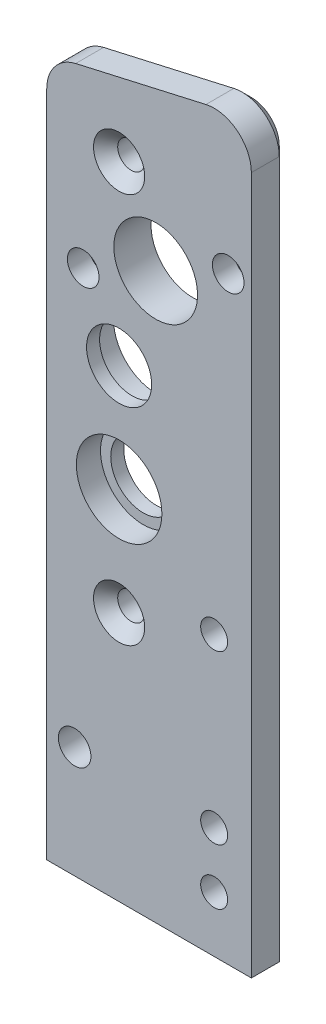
from build123d import *

# Parameters (mm, degrees)
RESSALTO_EXTRUS_O1_DEPTH                             = 4
FILETE1_R                                            = 4
CHANFRO1_SIZE                                        = 1
FURO_DE_DI_METRO_7_0_7_1_D                           = 7
ESCAREADO_PARA_PARAFUSO_COM_CABE_A_ESCAR_D           = 2.9
ESCAREADO_PARA_PARAFUSO_COM_CABE_A_ESCAR_CSINK_D     = 5.5
ESCAREADO_PARA_PARAFUSO_COM_CABE_A_ESCAR_CSINK_ANGLE = 90
BROCA_DE_ROSQUEAR_PARA_TARRAXA_DE_M21_D              = 1.6
BROCA_DE_ROSQUEAR_PARA_TARRAXA_DE_M21_DEPTH          = 8
BROCA_DE_ROSQUEAR_PARA_TARRAXA_DE_M21_TIP            = 0.480688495
FURO_DE_DI_METRO_9_0_9_3_D                           = 9
ESCAREADO_PARA_PARAFUSO_ALLEN_SEXTAVADO_D            = 3.4
ESCAREADO_PARA_PARAFUSO_ALLEN_SEXTAVADO_CSINK_D      = 6.72
ESCAREADO_PARA_PARAFUSO_ALLEN_SEXTAVADO_CSINK_ANGLE  = 90
ESCAREADO_PARA_PARAFUSO_COM_CABE_A_E_2_D             = 2.9
ESCAREADO_PARA_PARAFUSO_COM_CABE_A_E_2_DEPTH         = 4
ESCAREADO_PARA_PARAFUSO_COM_CABE_A_E_2_CSINK_D       = 5.5
ESCAREADO_PARA_PARAFUSO_COM_CABE_A_E_2_CSINK_ANGLE   = 90
ESCAREADO_PARA_PARAFUSO_COM_CABE_A_E_2_TIP           = 0.871247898
ESBO_O12_R                                           = 4.6
CORTE_EXTRUS_O1_DEPTH                                = 2.6
ESBO_O15_R                                           = 4.6
CORTE_EXTRUS_O2_DEPTH                                = 2.6
ESCAREADO_PARA_PARAFUSO_COM_CABE_A_E_3_D             = 2.9
ESCAREADO_PARA_PARAFUSO_COM_CABE_A_E_3_CSINK_D       = 5.5
ESCAREADO_PARA_PARAFUSO_COM_CABE_A_E_3_CSINK_ANGLE   = 90
FURO_DE_DI_METRO_7_0_7_2_D                           = 7
FURO_DE_DI_METRO_3_5_3_5_1_D                         = 3.5


with BuildPart() as part:
    # Esbo_o1 → Ressalto-extrus_o1 (new body)
    with BuildSketch(Plane.XY):
        Polygon((0, 0), (22, 0), (22, 80), (0, 75), align=None)
    extrude(amount=RESSALTO_EXTRUS_O1_DEPTH)

    # Filete1
    filete1_edges = [part.edges().sort_by_distance(p)[0] for p in [
        (0, 75, 2),
        (22, 80, 2),
    ]]
    fillet(filete1_edges, radius=FILETE1_R)

    # Chanfro1
    chanfro1_edges = [part.edges().sort_by_distance(p)[0] for p in [
        (10.113515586, 77.298526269, 0),
        (0, 35.903542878, 0),
        (0.873825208, 74.302487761, 0),
        (20.495402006, 78.115078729, 0),
        (22, 37.494451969, 0),
    ]]
    chamfer(chanfro1_edges, length=CHANFRO1_SIZE)

    # Furo de di_metro _7.0 _7_1 (through all)
    with Locations(Plane(origin=(7.780869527, 38.393713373, 0), x_dir=(-1, 0, 0), z_dir=(0, 0, -1))):
        with Locations((0, 0)):
            Hole(FURO_DE_DI_METRO_7_0_7_1_D / 2)

    # Escareado para parafuso com cabe_a escar (through all)
    with Locations(Plane(origin=(18, 6, 0), x_dir=(-1, 0, 0), z_dir=(0, 0, -1))):
        with Locations((0, 0), (0, 6)):
            CounterSinkHole(ESCAREADO_PARA_PARAFUSO_COM_CABE_A_ESCAR_D / 2, ESCAREADO_PARA_PARAFUSO_COM_CABE_A_ESCAR_CSINK_D / 2, counter_sink_angle=ESCAREADO_PARA_PARAFUSO_COM_CABE_A_ESCAR_CSINK_ANGLE)

    # Broca de rosquear para tarraxa de M21
    with Locations(Plane(origin=(4, 0, 2), x_dir=(0, 0, -1), z_dir=(0, -1, 0))):
        with Locations((0, 0), (0, 8)):
            Hole(BROCA_DE_ROSQUEAR_PARA_TARRAXA_DE_M21_D / 2, depth=BROCA_DE_ROSQUEAR_PARA_TARRAXA_DE_M21_DEPTH)
            with Locations((0, 0, -(BROCA_DE_ROSQUEAR_PARA_TARRAXA_DE_M21_DEPTH + BROCA_DE_ROSQUEAR_PARA_TARRAXA_DE_M21_TIP / 2))):  # 118° drill point
                Cone(0, BROCA_DE_ROSQUEAR_PARA_TARRAXA_DE_M21_D / 2, BROCA_DE_ROSQUEAR_PARA_TARRAXA_DE_M21_TIP, mode=Mode.SUBTRACT)

    # Furo de di_metro _9.0 _9_3 (through all)
    with Locations(Plane(origin=(11.714101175, 60.700178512, 0), x_dir=(-1, 0, 0), z_dir=(0, 0, -1))):
        with Locations((0, 0)):
            Hole(FURO_DE_DI_METRO_9_0_9_3_D / 2)

    # Escareado para parafuso Allen sextavado (through all)
    with Locations(Plane(origin=(19.508348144, 64.334695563, 0), x_dir=(-1, 0, 0), z_dir=(0, 0, -1))):
        with Locations((0, 0), (15.588493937, -7.269034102)):
            CounterSinkHole(ESCAREADO_PARA_PARAFUSO_ALLEN_SEXTAVADO_D / 2, ESCAREADO_PARA_PARAFUSO_ALLEN_SEXTAVADO_CSINK_D / 2, counter_sink_angle=ESCAREADO_PARA_PARAFUSO_ALLEN_SEXTAVADO_CSINK_ANGLE)

    # Escareado para parafuso com cabe_a e 2
    with Locations(Plane(origin=(18, 30, 0), x_dir=(-1, 0, 0), z_dir=(0, 0, -1))):
        with Locations((0, 0)):
            CounterSinkHole(ESCAREADO_PARA_PARAFUSO_COM_CABE_A_E_2_D / 2, ESCAREADO_PARA_PARAFUSO_COM_CABE_A_E_2_CSINK_D / 2, depth=ESCAREADO_PARA_PARAFUSO_COM_CABE_A_E_2_DEPTH, counter_sink_angle=ESCAREADO_PARA_PARAFUSO_COM_CABE_A_E_2_CSINK_ANGLE)
            with Locations((0, 0, -(ESCAREADO_PARA_PARAFUSO_COM_CABE_A_E_2_DEPTH + ESCAREADO_PARA_PARAFUSO_COM_CABE_A_E_2_TIP / 2))):  # 118° drill point
                Cone(0, ESCAREADO_PARA_PARAFUSO_COM_CABE_A_E_2_D / 2, ESCAREADO_PARA_PARAFUSO_COM_CABE_A_E_2_TIP, mode=Mode.SUBTRACT)

    # Esbo_o12 → Corte-extrus_o1 (cut)
    with BuildSketch(Plane.XY.offset(4)):
        with Locations((7.780869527, 38.393713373)):
            Circle(ESBO_O12_R)
    extrude(amount=-CORTE_EXTRUS_O1_DEPTH, mode=Mode.SUBTRACT)

    # Esbo_o15 → Corte-extrus_o2 (cut)
    with BuildSketch(Plane(origin=(0, 0, 0), x_dir=(-1, 0, 0), z_dir=(0, 0, -1))):
        with Locations((-7.780869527, 49.893713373)):
            Circle(ESBO_O15_R)
    extrude(amount=-CORTE_EXTRUS_O2_DEPTH, mode=Mode.SUBTRACT)

    # Escareado para parafuso com cabe_a e 3 (through all)
    with Locations(Plane(origin=(7.780869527, 68.893713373, 4), x_dir=(1, 0, 0), z_dir=(0, 0, 1))):
        with Locations((0, 0), (0, -42)):
            CounterSinkHole(ESCAREADO_PARA_PARAFUSO_COM_CABE_A_E_3_D / 2, ESCAREADO_PARA_PARAFUSO_COM_CABE_A_E_3_CSINK_D / 2, counter_sink_angle=ESCAREADO_PARA_PARAFUSO_COM_CABE_A_E_3_CSINK_ANGLE)

    # Furo de di_metro _7.0 _7_2 (through all)
    with Locations(Plane(origin=(7.780869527, 49.893713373, 0), x_dir=(-1, 0, 0), z_dir=(0, 0, -1))):
        with Locations((0, 0)):
            Hole(FURO_DE_DI_METRO_7_0_7_2_D / 2)

    # Furo de di_metro _3.5 _3.5_1 (through all)
    with Locations(Plane(origin=(3, 12, 0), x_dir=(-1, 0, 0), z_dir=(0, 0, -1))):
        with Locations((0, 0)):
            Hole(FURO_DE_DI_METRO_3_5_3_5_1_D / 2)


solid = part.part
